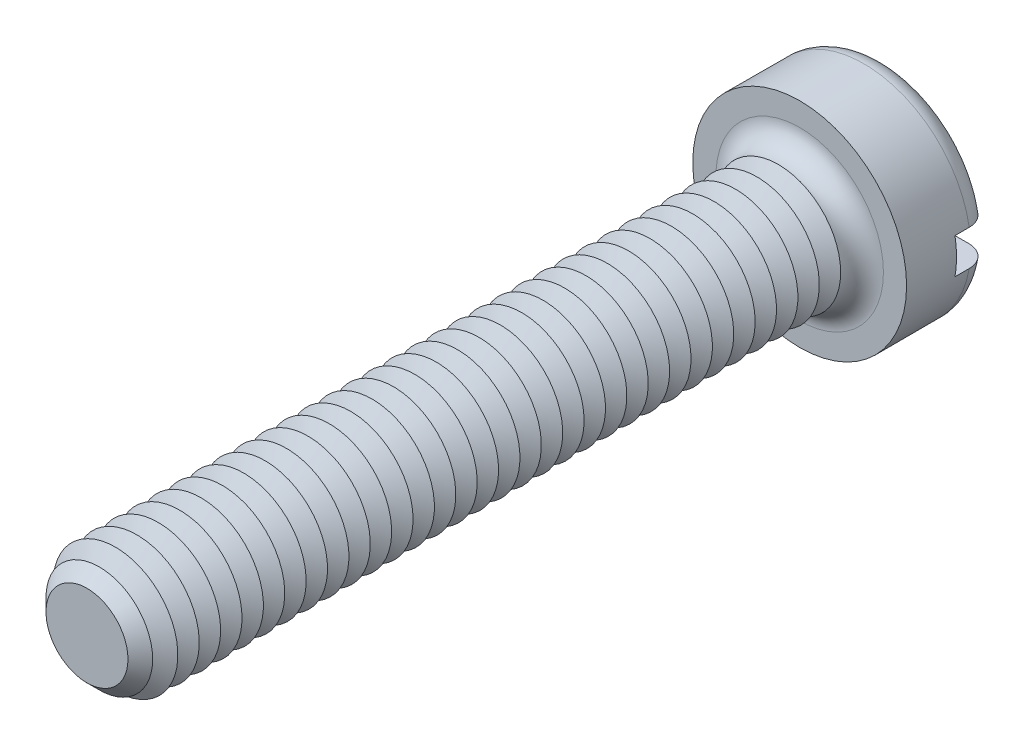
from build123d import *

# Parameters (mm, degrees)
SKETCH3_R           = 3
BOSS_EXTRUDE2_DEPTH = 2.4
SKETCH4_R           = 1.75
BOSS_EXTRUDE3_DEPTH = 20
FILLET1_R           = 0.6
CHAMFER1_SIZE       = 0.6
LPATTERN1_COUNT     = 32
LPATTERN1_PITCH     = 0.6
SKETCH8_W           = 6
SKETCH8_H           = 1
CUT_EXTRUDE1_DEPTH  = 1


with BuildPart() as part:
    # Sketch3 → Boss-Extrude2 (new body)
    with BuildSketch(Plane.XY):
        Circle(SKETCH3_R)
    extrude(amount=-BOSS_EXTRUDE2_DEPTH)

    # Sketch4 → Boss-Extrude3 (add)
    with BuildSketch(Plane.XY):
        Circle(SKETCH4_R)
    extrude(amount=BOSS_EXTRUDE3_DEPTH)

    # Fillet1
    fillet1_edges = [part.edges().sort_by_distance(p)[0] for p in [
        (-3, 0, -2.4),
        (-1.75, 0, 0),
    ]]
    fillet(fillet1_edges, radius=FILLET1_R)

    # Chamfer1
    chamfer1_edges = [part.edges().sort_by_distance(p)[0] for p in [
        (-1.75, 0, 20),
    ]]
    chamfer(chamfer1_edges, length=CHAMFER1_SIZE)

    # Sketch6 → Cut-Revolve1 (revolve, cut)
    with BuildSketch(Plane(origin=(0, 0, 0), x_dir=(0, 0, -1), z_dir=(1, 0, 0)), mode=Mode.PRIVATE) as cut_revolve1_sk:
        Polygon((-0.6, 1.75), (-0.9, 1.230384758), (-1.2, 1.75), align=None)
    cut_revolve1 = revolve(cut_revolve1_sk.sketch.rotate(Axis((0, 0, -1.694361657), (0, 0, 1)), 90), axis=Axis((0, 0, -1.694361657), (0, 0, 1)), mode=Mode.SUBTRACT)

    # LPattern1: Cut-Revolve1 ×32
    with Locations(*[(0, 0, i * LPATTERN1_PITCH) for i in range(1, LPATTERN1_COUNT)]):
        add(cut_revolve1, mode=Mode.SUBTRACT)

    # Sketch8 → Cut-Extrude1 (cut)
    with BuildSketch(Plane(origin=(0, 0, -2.4), x_dir=(-1, 0, 0), z_dir=(0, 0, -1))):
        Rectangle(SKETCH8_W, SKETCH8_H)
    extrude(amount=-CUT_EXTRUDE1_DEPTH, mode=Mode.SUBTRACT)


solid = part.part
